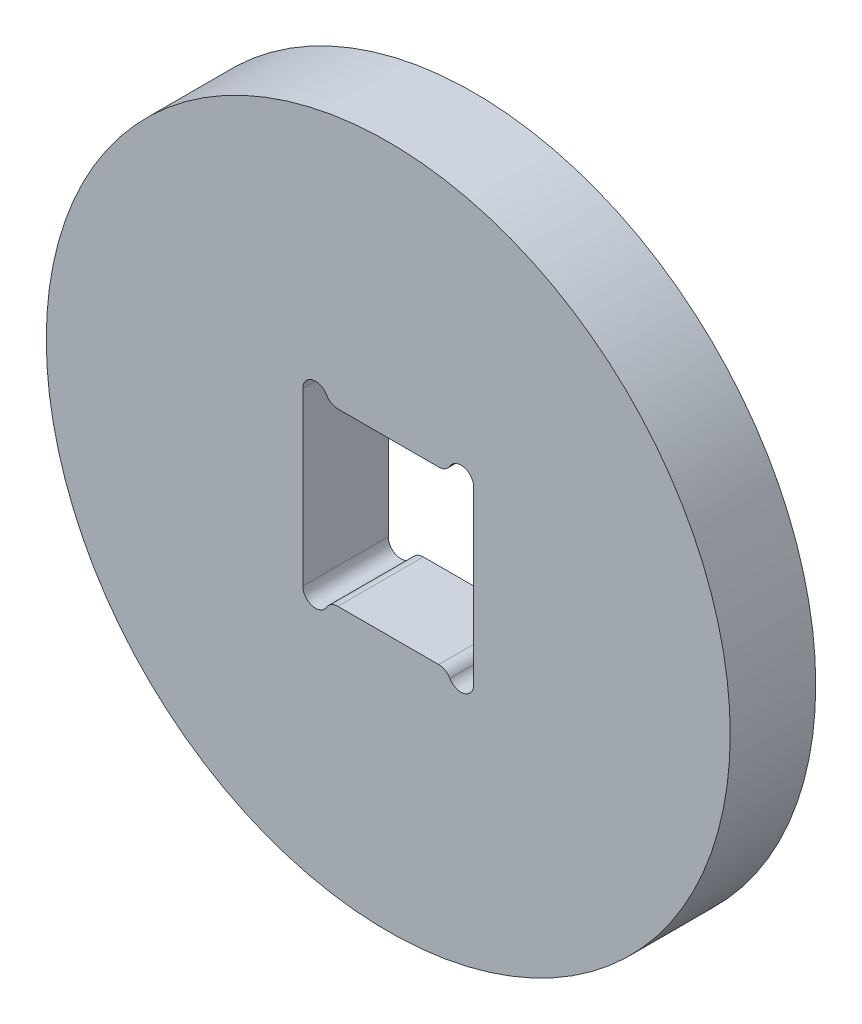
from build123d import *

# Parameters (mm, degrees)
ESQUISSE1_R        = 40
BOSS_EXTRU_1_DEPTH = 10


with BuildPart() as part:
    # Esquisse1 → Boss.-Extru.1 (new body)
    with BuildSketch(Plane.XY):
        Circle(ESQUISSE1_R)
        with BuildLine():
            Line((-5.901923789, 10), (5.901923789, 10))
            ThreePointArc((5.901923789, 10), (6.651923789, 10.200961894), (7.200961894, 10.75))
            ThreePointArc((7.200961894, 10.75), (8.888228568, 11.448888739), (10, 10))
            Line((10, 10), (10, -10))
            ThreePointArc((10, -10), (8.888228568, -11.448888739), (7.200961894, -10.75))
            ThreePointArc((7.200961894, -10.75), (6.651923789, -10.200961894), (5.901923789, -10))
            Line((5.901923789, -10), (-5.901923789, -10))
            ThreePointArc((-5.901923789, -10), (-6.651923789, -10.200961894), (-7.200961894, -10.75))
            ThreePointArc((-7.200961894, -10.75), (-8.888228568, -11.448888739), (-10, -10))
            Line((-10, -10), (-10, 10))
            ThreePointArc((-10, 10), (-8.888228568, 11.448888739), (-7.200961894, 10.75))
            ThreePointArc((-7.200961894, 10.75), (-6.651923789, 10.200961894), (-5.901923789, 10))
        make_face(mode=Mode.SUBTRACT)
    extrude(amount=BOSS_EXTRU_1_DEPTH)


solid = part.part
